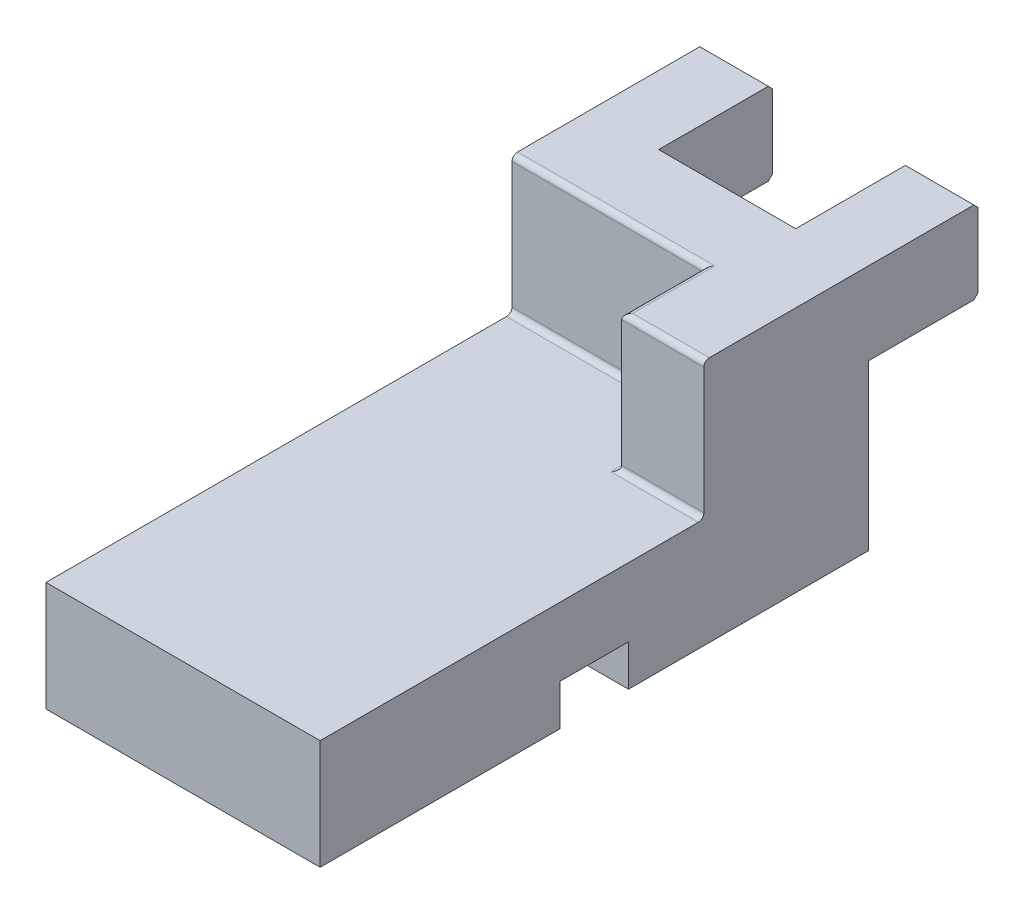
from build123d import *

# Parameters (mm, degrees)
SKIZZE1_W                       = 200
SKIZZE1_H                       = 40
AUFSATZ_LINEAR_AUSTRAGEN1_DEPTH = 50
SKIZZE2_W                       = 25
SKIZZE2_H                       = 15
SCHNITT_LINEAR_AUSTRAGEN1_DEPTH = 143.828568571
AUFSATZ_LINEAR_AUSTRAGEN2_DEPTH = 50
SKIZZE4_W                       = 25
SKIZZE4_H                       = 30
AUFSATZ_LINEAR_AUSTRAGEN3_DEPTH = 40
VERRUNDUNG1_R                   = 2
VERRUNDUNG2_R                   = 2
FASE1_SIZE                      = 1.5


with BuildPart() as part:
    # Skizze1 → Aufsatz-Linear austragen1 (new, symmetric)
    with BuildSketch(Plane(origin=(0, 0, 0), x_dir=(0, 0, -1), z_dir=(1, 0, 0))):
        Rectangle(SKIZZE1_W, SKIZZE1_H)
    extrude(amount=AUFSATZ_LINEAR_AUSTRAGEN1_DEPTH, both=True)

    # Skizze2 → Schnitt-Linear austragen1 (cut, through all)
    with BuildSketch(Plane(origin=(50, 0, 0), x_dir=(0, 0, -1), z_dir=(1, 0, 0))):
        with Locations((0, -12.5)):
            Rectangle(SKIZZE2_W, SKIZZE2_H)
    extrude(amount=-SCHNITT_LINEAR_AUSTRAGEN1_DEPTH, mode=Mode.SUBTRACT)

    # Skizze3 → Aufsatz-Linear austragen2 (add)
    with BuildSketch(Plane(origin=(0, 20, 0), x_dir=(1, 0, 0), z_dir=(0, 1, 0))):
        Polygon((50, 100), (50, 40), (20, 40), (20, 70), (-50, 70), (-50, 100), align=None)
    extrude(amount=AUFSATZ_LINEAR_AUSTRAGEN2_DEPTH)

    # Skizze4 → Aufsatz-Linear austragen3 (add)
    with BuildSketch(Plane(origin=(0, 0, -100), x_dir=(-1, 0, 0), z_dir=(0, 0, -1))):
        with Locations((-37.5, 55)):
            Rectangle(SKIZZE4_W, SKIZZE4_H)
        with Locations((37.5, 55)):
            Rectangle(SKIZZE4_W, SKIZZE4_H)
    extrude(amount=AUFSATZ_LINEAR_AUSTRAGEN3_DEPTH)

    # Verrundung1
    verrundung1_edges = [part.edges().sort_by_distance(p)[0] for p in [
        (-15, 20, -70),
        (20, 20, -55),
        (35, 20, -40),
    ]]
    fillet(verrundung1_edges, radius=VERRUNDUNG1_R)

    # Verrundung2
    verrundung2_edges = [part.edges().sort_by_distance(p)[0] for p in [
        (-15, 70, -70),
        (20, 70, -55),
        (35, 70, -40),
    ]]
    fillet(verrundung2_edges, radius=VERRUNDUNG2_R)

    # Fase1
    fase1_edges = [part.edges().sort_by_distance(p)[0] for p in [
        (0, 70, -100),
        (37.5, 40, -140),
        (37.5, 70, -140),
        (-37.5, 70, -140),
        (-37.5, 40, -140),
    ]]
    chamfer(fase1_edges, length=FASE1_SIZE)


solid = part.part
